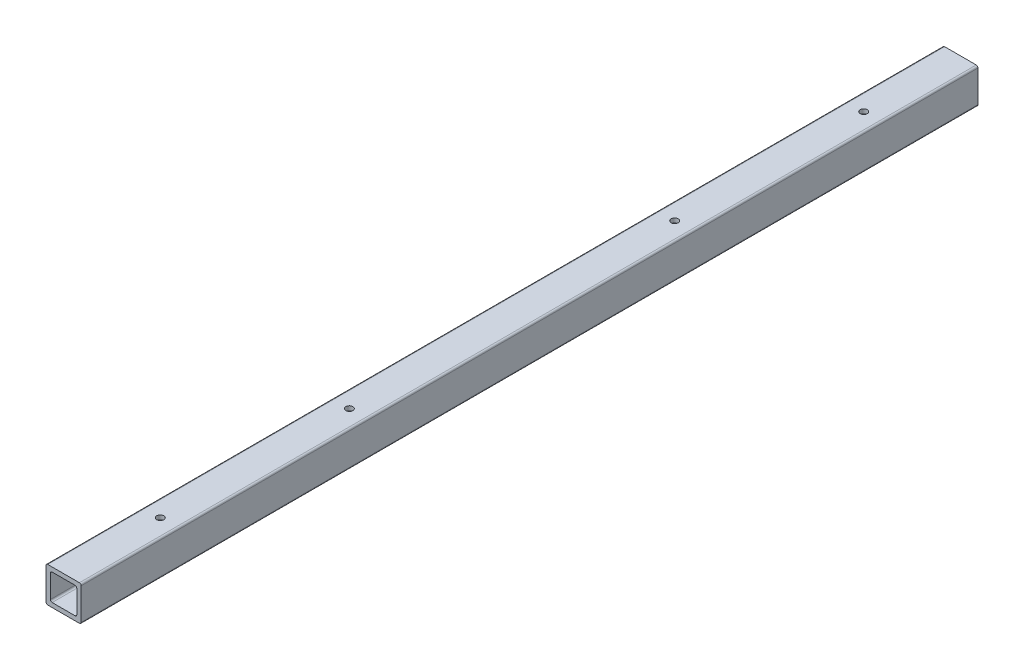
from build123d import *

# Parameters (mm, degrees)
EXTRUDE1_DEPTH     = 647.7
SKETCH2_R          = 5.08
CUT_EXTRUDE1_DEPTH = 651.185427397


with BuildPart() as part:
    # Sketch1 → Extrude1 (new, symmetric)
    with BuildSketch(Plane.XY):
        with BuildLine():
            Line((-22.86, -25.4), (22.86, -25.4))
            ThreePointArc((22.86, -25.4), (24.656051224, -24.656051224), (25.4, -22.86))
            Line((25.4, -22.86), (25.4, 22.86))
            ThreePointArc((25.4, 22.86), (24.656051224, 24.656051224), (22.86, 25.4))
            Line((22.86, 25.4), (-22.86, 25.4))
            ThreePointArc((-22.86, 25.4), (-24.656051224, 24.656051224), (-25.4, 22.86))
            Line((-25.4, 22.86), (-25.4, -22.86))
            ThreePointArc((-25.4, -22.86), (-24.656051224, -24.656051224), (-22.86, -25.4))
        make_face()
        with BuildLine():
            Line((-16.51, -19.05), (16.51, -19.05))
            ThreePointArc((16.51, -19.05), (18.306051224, -18.306051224), (19.05, -16.51))
            Line((19.05, -16.51), (19.05, 16.51))
            ThreePointArc((19.05, 16.51), (18.306051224, 18.306051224), (16.51, 19.05))
            Line((16.51, 19.05), (-16.51, 19.05))
            ThreePointArc((-16.51, 19.05), (-18.306051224, 18.306051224), (-19.05, 16.51))
            Line((-19.05, 16.51), (-19.05, -16.51))
            ThreePointArc((-19.05, -16.51), (-18.306051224, -18.306051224), (-16.51, -19.05))
        make_face(mode=Mode.SUBTRACT)
    extrude(amount=EXTRUDE1_DEPTH, both=True)

    # Sketch2 → Cut-Extrude1 (cut, through all)
    with BuildSketch(Plane(origin=(0, 25.4, 0), x_dir=(-1, 0, 0), z_dir=(0, 1, 0))):
        with Locations((0, 234.95)):
            Circle(SKETCH2_R)
        with Locations((0, -234.95)):
            Circle(SKETCH2_R)
        with Locations((0, 508)):
            Circle(SKETCH2_R)
        with Locations((0, -508)):
            Circle(SKETCH2_R)
    extrude(amount=-CUT_EXTRUDE1_DEPTH, mode=Mode.SUBTRACT)


solid = part.part
